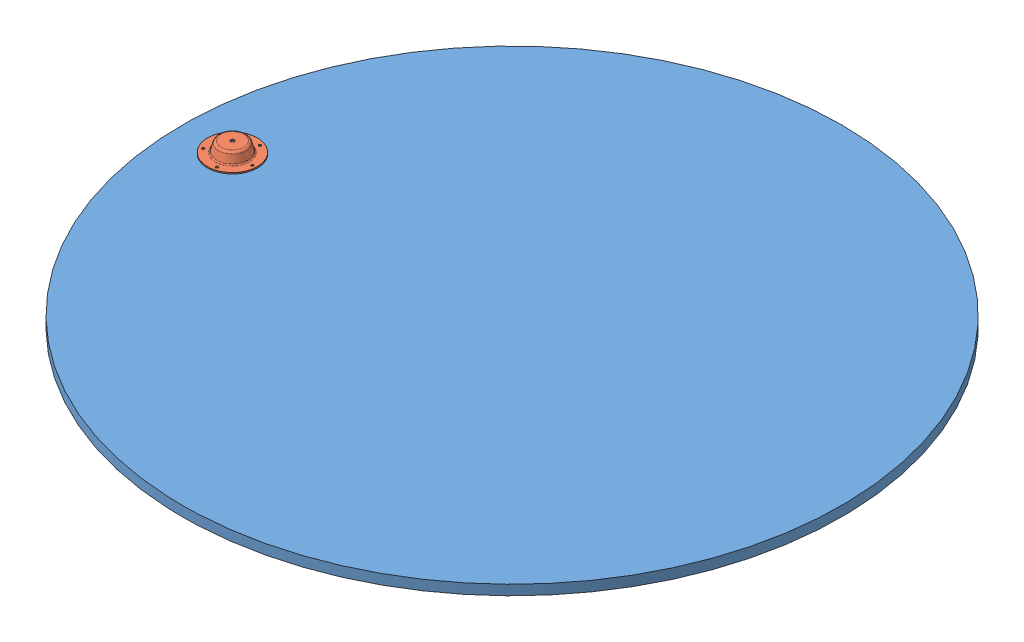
SolidWorks assembly Table Assy.SLDASM, configuration Default (file format 4700). Lengths in mm.
Overall size (1676.4 53.98 1676.4).
2 component instances, 2 part files, 3 mates.
Components (placement in the parent):
- Table Top-1: Table Top.SLDPRT [Default] at origin size (1676.4 25.4 1676.4)
- Flange-1: Flange.SLDPRT [Default] at (-711.2 25.4 0) x (0.997948 0 0.064024) z (-0.064024 0 0.997948) size (127 28.57 127)
Mates (geometry in assembly coordinates):
- Coincident1: coincident anti-aligned: plane of Table Top-1 through (0 25.4 0) normal (0 1 0); plane of Flange-1 through (-774.5697 25.4 -4.0655) normal (0 -1 0)
- Distance1: distance = 711.2 mm: axis of Table Top-1 through (0 25.4 0) axis (0 -1 0); axis of Flange-1 through (-711.2 25.4 0) axis (0 1 0)
- Coincident3: coincident: plane of Table Top-1; axis of Flange-1 through (-711.2 50.8 0) axis (0 1 0)
